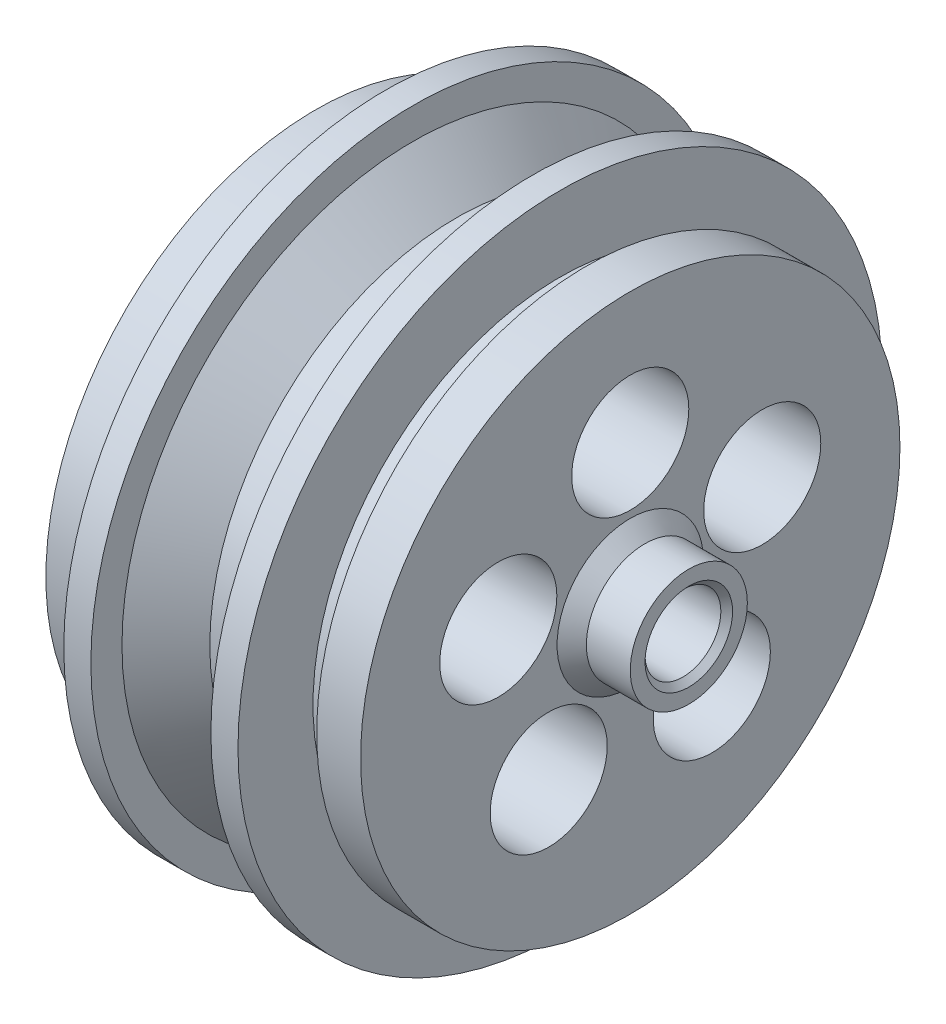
from build123d import *

# Parameters (mm, degrees)
SKETCH1_R               = 16.875
BOSS_EXTRUDE1_DEPTH     = 8.2
SKETCH2_R               = 22
BOSS_EXTRUDE2_DEPTH     = 1.85
SKETCH3_R               = 16.875
BOSS_EXTRUDE3_DEPTH     = 1.8
SKETCH4_R               = 18.425
BOSS_EXTRUDE4_DEPTH     = 3
CUT_EXTRUDE1_DEPTH      = 38.818646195
CUT_EXTRUDE1_DEPTH_BACK = 38.818646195
SKETCH5_R               = 2.59
SKETCH6_R               = 4
CUT_EXTRUDE2_DEPTH      = 38.818646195
CIRPATTERN1_COUNT       = 5
CHAMFER1_SIZE           = 3
BOSS_EXTRUDE5_START     = 4
SKETCH7_R               = 4
SKETCH7_R_2             = 2.59
BOSS_EXTRUDE5_DEPTH     = 4
CHAMFER2_SIZE           = 1
CHAMFER3_SIZE           = 0.4


with BuildPart() as part:
    # Sketch1 → Boss-Extrude1 (new body)
    with BuildSketch(Plane(origin=(0, 0, 0), x_dir=(0, 0, -1), z_dir=(1, 0, 0))):
        Circle(SKETCH1_R)
    extrude(amount=BOSS_EXTRUDE1_DEPTH)

    # Sketch2 → Boss-Extrude2 (add)
    with BuildSketch(Plane(origin=(8.2, 0, 0), x_dir=(0, 0, -1), z_dir=(1, 0, 0))):
        Circle(SKETCH2_R)
    boss_extrude2 = extrude(amount=BOSS_EXTRUDE2_DEPTH)

    # Sketch3 → Boss-Extrude3 (add)
    with BuildSketch(Plane(origin=(10.05, 0, 0), x_dir=(0, 0, -1), z_dir=(1, 0, 0))):
        Circle(SKETCH3_R)
    boss_extrude3 = extrude(amount=BOSS_EXTRUDE3_DEPTH)

    # Sketch4 → Boss-Extrude4 (add)
    with BuildSketch(Plane(origin=(11.85, 0, 0), x_dir=(0, 0, -1), z_dir=(1, 0, 0))):
        Circle(SKETCH4_R)
    boss_extrude4 = extrude(amount=BOSS_EXTRUDE4_DEPTH)

    # Mirror1: Boss-Extrude2, Boss-Extrude3, Boss-Extrude4 across plane
    add(boss_extrude2.mirror(Plane.ZY.offset(-4.1)))
    add(boss_extrude3.mirror(Plane.ZY.offset(-4.1)))
    add(boss_extrude4.mirror(Plane.ZY.offset(-4.1)))

    # Sketch5 → Cut-Extrude1 (cut, two sides: drawn at the far end of the back side and taken through both)
    with BuildSketch(Plane(origin=(14.85, 0, 0), x_dir=(0, 0, -1), z_dir=(1, 0, 0)).offset(-CUT_EXTRUDE1_DEPTH_BACK)):
        Circle(SKETCH5_R)
    extrude(amount=CUT_EXTRUDE1_DEPTH + CUT_EXTRUDE1_DEPTH_BACK, mode=Mode.SUBTRACT)

    # Sketch6 → Cut-Extrude2 (cut, symmetric)
    with BuildSketch(Plane(origin=(14.85, 0, 0), x_dir=(0, 0, -1), z_dir=(1, 0, 0))):
        with Locations((0, 9.479837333)):
            Circle(SKETCH6_R)
    cut_extrude2 = extrude(amount=CUT_EXTRUDE2_DEPTH, both=True, mode=Mode.SUBTRACT)

    # CirPattern1: Cut-Extrude2 ×5 about axis
    cirpattern1_axis = Axis((0, 0, 0), (1, 0, 0))
    for i in range(1, CIRPATTERN1_COUNT):
        add(cut_extrude2.rotate(cirpattern1_axis, i * 360 / CIRPATTERN1_COUNT), mode=Mode.SUBTRACT)

    # Chamfer1
    chamfer1_edges = [part.edges().sort_by_distance(p)[0] for p in [
        (0, 0, 16.875),
        (8.2, 0, 16.875),
    ]]
    chamfer(chamfer1_edges, length=CHAMFER1_SIZE)

    # Sketch7 → Boss-Extrude5 (add)
    with BuildSketch(Plane(origin=(14.85, 0, 0), x_dir=(0, 0, -1), z_dir=(1, 0, 0)).offset(BOSS_EXTRUDE5_START)):
        Circle(SKETCH7_R)
        Circle(SKETCH7_R_2, mode=Mode.SUBTRACT)
    extrude(amount=-BOSS_EXTRUDE5_DEPTH)

    # Chamfer2
    chamfer2_edges = [part.edges().sort_by_distance(p)[0] for p in [
        (14.85, 0, 4),
    ]]
    chamfer(chamfer2_edges, length=CHAMFER2_SIZE)

    # Chamfer3
    chamfer3_edges = [part.edges().sort_by_distance(p)[0] for p in [
        (18.85, 0, 2.59),
    ]]
    chamfer(chamfer3_edges, length=CHAMFER3_SIZE)


solid = part.part
